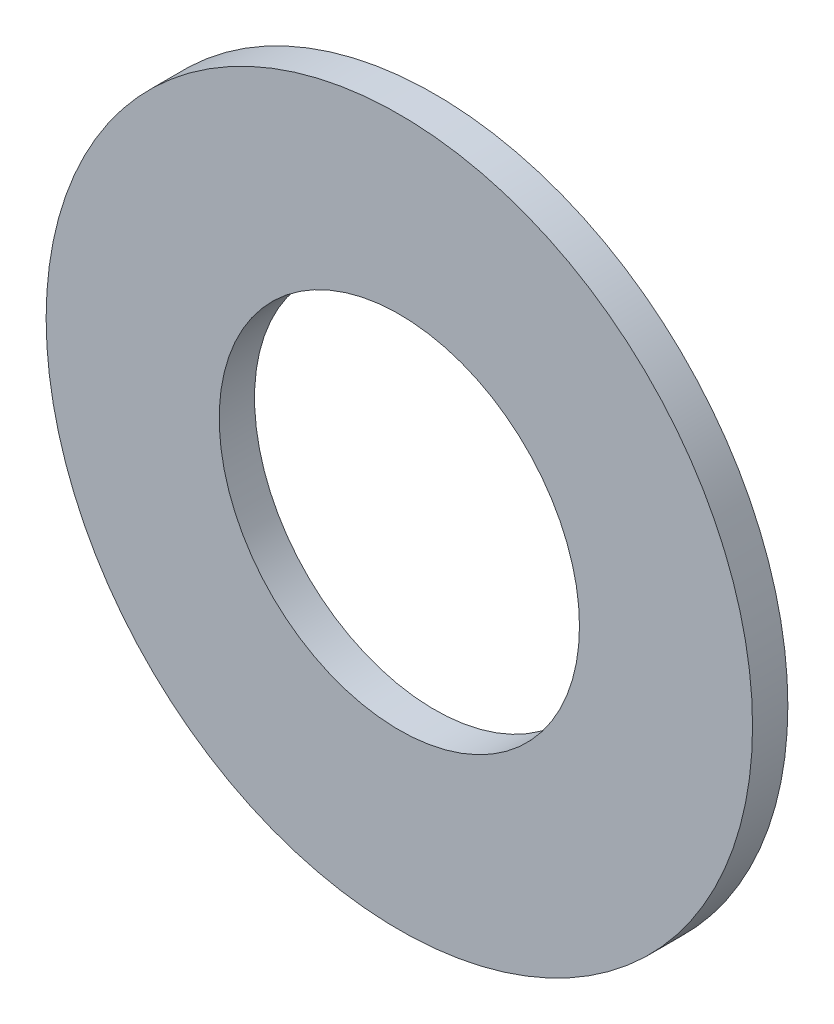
from build123d import *

# Parameters (mm, degrees)
ESQUISSE1_R          = 10
ESQUISSE1_R_2        = 5.1
BASE_EXTRUSION_DEPTH = 1


with BuildPart() as part:
    # Esquisse1 → Base-Extrusion (new body)
    with BuildSketch(Plane.XY):
        Circle(ESQUISSE1_R)
        Circle(ESQUISSE1_R_2, mode=Mode.SUBTRACT)
    extrude(amount=BASE_EXTRUSION_DEPTH)


solid = part.part
